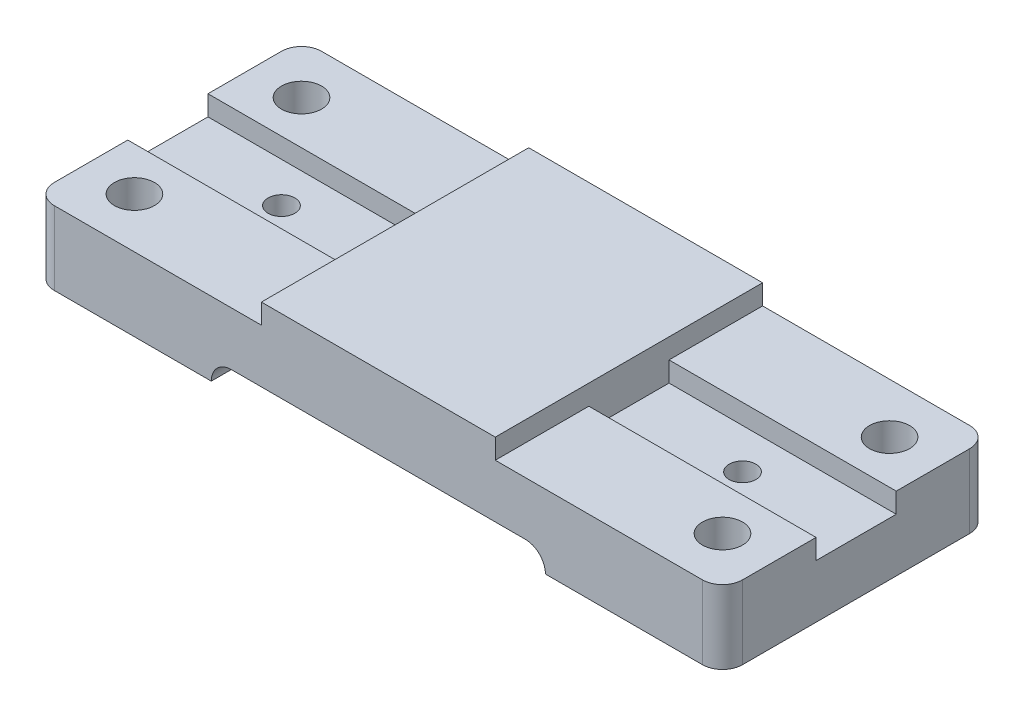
ISO-10303-21;
HEADER;
FILE_DESCRIPTION(('STEP AP214'),'2;1');
FILE_NAME('part.step','',(''),(''),'','','');
FILE_SCHEMA(('AUTOMOTIVE_DESIGN { 1 0 10303 214 1 1 1 1 }'));
ENDSEC;
DATA;
#1=APPLICATION_CONTEXT('core data for automotive mechanical design processes');
#2=APPLICATION_PROTOCOL_DEFINITION('international standard','automotive_design',2000,#1);
#3=PRODUCT_CONTEXT('',#1,'mechanical');
#4=PRODUCT('Part','Part','',(#3));
#5=PRODUCT_RELATED_PRODUCT_CATEGORY('part','',(#4));
#6=PRODUCT_DEFINITION_FORMATION('','',#4);
#7=PRODUCT_DEFINITION_CONTEXT('part definition',#1,'design');
#8=PRODUCT_DEFINITION('design','',#6,#7);
#9=PRODUCT_DEFINITION_SHAPE('','',#8);
#10=(LENGTH_UNIT() NAMED_UNIT(*) SI_UNIT(.MILLI.,.METRE.));
#11=(NAMED_UNIT(*) PLANE_ANGLE_UNIT() SI_UNIT($,.RADIAN.));
#12=(NAMED_UNIT(*) SI_UNIT($,.STERADIAN.) SOLID_ANGLE_UNIT());
#13=UNCERTAINTY_MEASURE_WITH_UNIT(LENGTH_MEASURE(1.E-05),#10,'distance_accuracy_value','');
#14=(GEOMETRIC_REPRESENTATION_CONTEXT(3) GLOBAL_UNCERTAINTY_ASSIGNED_CONTEXT((#13)) GLOBAL_UNIT_ASSIGNED_CONTEXT((#10,
#11,#12)) REPRESENTATION_CONTEXT('',''));
#15=CARTESIAN_POINT('',(0.,0.,0.));
#16=DIRECTION('',(0.,0.,1.));
#17=DIRECTION('',(1.,0.,0.));
#18=AXIS2_PLACEMENT_3D('',#15,#16,#17);
#19=CARTESIAN_POINT('',(200.,22.,-74.));
#20=DIRECTION('',(0.,1.,0.));
#21=DIRECTION('',(0.,0.,1.));
#22=AXIS2_PLACEMENT_3D('',#19,#20,#21);
#23=PLANE('',#22);
#24=DIRECTION('',(0.,0.,-1.));
#25=VECTOR('',#24,1.);
#26=CARTESIAN_POINT('',(138.,22.,-80.));
#27=LINE('',#26,#25);
#28=CARTESIAN_POINT('',(138.,22.,0.));
#29=VERTEX_POINT('',#28);
#30=CARTESIAN_POINT('',(138.,22.,-28.));
#31=VERTEX_POINT('',#30);
#32=EDGE_CURVE('E48',#29,#31,#27,.T.);
#33=ORIENTED_EDGE('',*,*,#32,.F.);
#34=DIRECTION('',(1.,0.,0.));
#35=VECTOR('',#34,1.);
#36=CARTESIAN_POINT('',(6.00000000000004,22.,0.));
#37=LINE('',#36,#35);
#38=CARTESIAN_POINT('',(200.,22.,0.));
#39=VERTEX_POINT('',#38);
#40=EDGE_CURVE('E208',#29,#39,#37,.T.);
#41=ORIENTED_EDGE('',*,*,#40,.T.);
#42=CARTESIAN_POINT('',(200.,22.,-6.));
#43=DIRECTION('',(0.,1.,0.));
#44=DIRECTION('',(0.,0.,1.));
#45=AXIS2_PLACEMENT_3D('',#42,#43,#44);
#46=CIRCLE('',#45,6.);
#47=CARTESIAN_POINT('',(206.,22.,-6.00000000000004));
#48=VERTEX_POINT('',#47);
#49=EDGE_CURVE('E207',#39,#48,#46,.T.);
#50=ORIENTED_EDGE('',*,*,#49,.T.);
#51=DIRECTION('',(0.,0.,-1.));
#52=VECTOR('',#51,1.);
#53=CARTESIAN_POINT('',(206.,22.,-6.00000000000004));
#54=LINE('',#53,#52);
#55=CARTESIAN_POINT('',(206.,22.,-28.));
#56=VERTEX_POINT('',#55);
#57=EDGE_CURVE('E416',#48,#56,#54,.T.);
#58=ORIENTED_EDGE('',*,*,#57,.T.);
#59=DIRECTION('',(1.,0.,0.));
#60=VECTOR('',#59,1.);
#61=CARTESIAN_POINT('',(-69.0302807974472,22.,-28.));
#62=LINE('',#61,#60);
#63=EDGE_CURVE('E273',#31,#56,#62,.T.);
#64=ORIENTED_EDGE('',*,*,#63,.F.);
#65=EDGE_LOOP('',(#33,#41,#50,#58,#64));
#66=FACE_BOUND('',#65,.T.);
#67=CARTESIAN_POINT('',(191.,22.,-15.));
#68=DIRECTION('',(0.,1.,0.));
#69=DIRECTION('',(0.,0.,1.));
#70=AXIS2_PLACEMENT_3D('',#67,#68,#69);
#71=CIRCLE('',#70,6.00000000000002);
#72=CARTESIAN_POINT('',(191.,22.,-8.99999999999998));
#73=VERTEX_POINT('',#72);
#74=EDGE_CURVE('E340',#73,#73,#71,.T.);
#75=ORIENTED_EDGE('',*,*,#74,.F.);
#76=EDGE_LOOP('',(#75));
#77=FACE_BOUND('',#76,.T.);
#78=ADVANCED_FACE('F31',(#66,#77),#23,.T.);
#79=CARTESIAN_POINT('',(138.,22.,-52.));
#80=VERTEX_POINT('',#79);
#81=CARTESIAN_POINT('',(138.,22.,-80.));
#82=VERTEX_POINT('',#81);
#83=EDGE_CURVE('E11',#80,#82,#27,.T.);
#84=ORIENTED_EDGE('',*,*,#83,.F.);
#85=DIRECTION('',(1.,0.,0.));
#86=VECTOR('',#85,1.);
#87=CARTESIAN_POINT('',(-69.0302807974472,22.,-52.));
#88=LINE('',#87,#86);
#89=CARTESIAN_POINT('',(206.,22.,-52.));
#90=VERTEX_POINT('',#89);
#91=EDGE_CURVE('E228',#80,#90,#88,.T.);
#92=ORIENTED_EDGE('',*,*,#91,.T.);
#93=CARTESIAN_POINT('',(206.,22.,-74.));
#94=VERTEX_POINT('',#93);
#95=EDGE_CURVE('E419',#90,#94,#54,.T.);
#96=ORIENTED_EDGE('',*,*,#95,.T.);
#97=CARTESIAN_POINT('',(200.,22.,-74.));
#98=DIRECTION('',(0.,1.,0.));
#99=DIRECTION('',(0.,0.,1.));
#100=AXIS2_PLACEMENT_3D('',#97,#98,#99);
#101=CIRCLE('',#100,6.00000000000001);
#102=CARTESIAN_POINT('',(200.,22.,-80.));
#103=VERTEX_POINT('',#102);
#104=EDGE_CURVE('E381',#94,#103,#101,.T.);
#105=ORIENTED_EDGE('',*,*,#104,.T.);
#106=DIRECTION('',(-1.,0.,0.));
#107=VECTOR('',#106,1.);
#108=CARTESIAN_POINT('',(6.00000000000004,22.,-80.));
#109=LINE('',#108,#107);
#110=EDGE_CURVE('E392',#103,#82,#109,.T.);
#111=ORIENTED_EDGE('',*,*,#110,.T.);
#112=EDGE_LOOP('',(#84,#92,#96,#105,#111));
#113=FACE_BOUND('',#112,.T.);
#114=CARTESIAN_POINT('',(191.,22.,-65.));
#115=DIRECTION('',(0.,1.,0.));
#116=DIRECTION('',(0.,0.,1.));
#117=AXIS2_PLACEMENT_3D('',#114,#115,#116);
#118=CIRCLE('',#117,6.00000000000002);
#119=CARTESIAN_POINT('',(191.,22.,-59.));
#120=VERTEX_POINT('',#119);
#121=EDGE_CURVE('E352',#120,#120,#118,.T.);
#122=ORIENTED_EDGE('',*,*,#121,.F.);
#123=EDGE_LOOP('',(#122));
#124=FACE_BOUND('',#123,.T.);
#125=ADVANCED_FACE('F523',(#113,#124),#23,.T.);
#126=DIRECTION('',(0.,0.,1.));
#127=VECTOR('',#126,1.);
#128=CARTESIAN_POINT('',(68.,22.,-80.));
#129=LINE('',#128,#127);
#130=CARTESIAN_POINT('',(68.,22.,-80.));
#131=VERTEX_POINT('',#130);
#132=CARTESIAN_POINT('',(68.,22.,-52.));
#133=VERTEX_POINT('',#132);
#134=EDGE_CURVE('E56',#131,#133,#129,.T.);
#135=ORIENTED_EDGE('',*,*,#134,.F.);
#136=CARTESIAN_POINT('',(6.00000000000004,22.,-80.));
#137=VERTEX_POINT('',#136);
#138=EDGE_CURVE('E384',#131,#137,#109,.T.);
#139=ORIENTED_EDGE('',*,*,#138,.T.);
#140=CARTESIAN_POINT('',(6.,22.,-74.));
#141=DIRECTION('',(0.,1.,0.));
#142=DIRECTION('',(0.,0.,1.));
#143=AXIS2_PLACEMENT_3D('',#140,#141,#142);
#144=CIRCLE('',#143,6.);
#145=CARTESIAN_POINT('',(0.,22.,-74.));
#146=VERTEX_POINT('',#145);
#147=EDGE_CURVE('E387',#137,#146,#144,.T.);
#148=ORIENTED_EDGE('',*,*,#147,.T.);
#149=DIRECTION('',(0.,0.,1.));
#150=VECTOR('',#149,1.);
#151=CARTESIAN_POINT('',(0.,22.,-6.00000000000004));
#152=LINE('',#151,#150);
#153=CARTESIAN_POINT('',(0.,22.,-52.));
#154=VERTEX_POINT('',#153);
#155=EDGE_CURVE('E568',#146,#154,#152,.T.);
#156=ORIENTED_EDGE('',*,*,#155,.T.);
#157=DIRECTION('',(1.,0.,0.));
#158=VECTOR('',#157,1.);
#159=CARTESIAN_POINT('',(-69.0302807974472,22.,-52.));
#160=LINE('',#159,#158);
#161=EDGE_CURVE('E244',#154,#133,#160,.T.);
#162=ORIENTED_EDGE('',*,*,#161,.T.);
#163=EDGE_LOOP('',(#135,#139,#148,#156,#162));
#164=FACE_BOUND('',#163,.T.);
#165=CARTESIAN_POINT('',(15.,22.,-65.));
#166=DIRECTION('',(0.,1.,0.));
#167=DIRECTION('',(0.,0.,1.));
#168=AXIS2_PLACEMENT_3D('',#165,#166,#167);
#169=CIRCLE('',#168,6.);
#170=CARTESIAN_POINT('',(15.,22.,-59.));
#171=VERTEX_POINT('',#170);
#172=EDGE_CURVE('E358',#171,#171,#169,.T.);
#173=ORIENTED_EDGE('',*,*,#172,.F.);
#174=EDGE_LOOP('',(#173));
#175=FACE_BOUND('',#174,.T.);
#176=ADVANCED_FACE('F528',(#164,#175),#23,.T.);
#177=CARTESIAN_POINT('',(68.,22.,-28.));
#178=VERTEX_POINT('',#177);
#179=CARTESIAN_POINT('',(68.,22.,0.));
#180=VERTEX_POINT('',#179);
#181=EDGE_CURVE('E40',#178,#180,#129,.T.);
#182=ORIENTED_EDGE('',*,*,#181,.F.);
#183=DIRECTION('',(1.,0.,0.));
#184=VECTOR('',#183,1.);
#185=CARTESIAN_POINT('',(-69.0302807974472,22.,-28.));
#186=LINE('',#185,#184);
#187=CARTESIAN_POINT('',(0.,22.,-28.));
#188=VERTEX_POINT('',#187);
#189=EDGE_CURVE('E241',#188,#178,#186,.T.);
#190=ORIENTED_EDGE('',*,*,#189,.F.);
#191=CARTESIAN_POINT('',(0.,22.,-6.00000000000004));
#192=VERTEX_POINT('',#191);
#193=EDGE_CURVE('E567',#188,#192,#152,.T.);
#194=ORIENTED_EDGE('',*,*,#193,.T.);
#195=CARTESIAN_POINT('',(6.,22.,-6.));
#196=DIRECTION('',(0.,1.,0.));
#197=DIRECTION('',(0.,0.,-1.));
#198=AXIS2_PLACEMENT_3D('',#195,#196,#197);
#199=CIRCLE('',#198,6.);
#200=CARTESIAN_POINT('',(6.00000000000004,22.,0.));
#201=VERTEX_POINT('',#200);
#202=EDGE_CURVE('E202',#192,#201,#199,.T.);
#203=ORIENTED_EDGE('',*,*,#202,.T.);
#204=EDGE_CURVE('E195',#201,#180,#37,.T.);
#205=ORIENTED_EDGE('',*,*,#204,.T.);
#206=EDGE_LOOP('',(#182,#190,#194,#203,#205));
#207=FACE_BOUND('',#206,.T.);
#208=CARTESIAN_POINT('',(15.,22.,-15.));
#209=DIRECTION('',(0.,1.,0.));
#210=DIRECTION('',(0.,0.,1.));
#211=AXIS2_PLACEMENT_3D('',#208,#209,#210);
#212=CIRCLE('',#211,6.);
#213=CARTESIAN_POINT('',(15.,22.,-9.));
#214=VERTEX_POINT('',#213);
#215=EDGE_CURVE('E346',#214,#214,#212,.T.);
#216=ORIENTED_EDGE('',*,*,#215,.F.);
#217=EDGE_LOOP('',(#216));
#218=FACE_BOUND('',#217,.T.);
#219=ADVANCED_FACE('F197',(#207,#218),#23,.T.);
#220=CARTESIAN_POINT('',(206.,22.,-6.00000000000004));
#221=DIRECTION('',(-1.,0.,0.));
#222=DIRECTION('',(0.,0.,1.));
#223=AXIS2_PLACEMENT_3D('',#220,#221,#222);
#224=PLANE('',#223);
#225=DIRECTION('',(0.,1.,0.));
#226=VECTOR('',#225,1.);
#227=CARTESIAN_POINT('',(206.,16.,-52.));
#228=LINE('',#227,#226);
#229=CARTESIAN_POINT('',(206.,16.,-52.));
#230=VERTEX_POINT('',#229);
#231=EDGE_CURVE('E254',#230,#90,#228,.T.);
#232=ORIENTED_EDGE('',*,*,#231,.F.);
#233=DIRECTION('',(0.,0.,-1.));
#234=VECTOR('',#233,1.);
#235=CARTESIAN_POINT('',(206.,16.,-40.));
#236=LINE('',#235,#234);
#237=CARTESIAN_POINT('',(206.,16.,-28.));
#238=VERTEX_POINT('',#237);
#239=EDGE_CURVE('E268',#238,#230,#236,.T.);
#240=ORIENTED_EDGE('',*,*,#239,.F.);
#241=DIRECTION('',(0.,1.,0.));
#242=VECTOR('',#241,1.);
#243=CARTESIAN_POINT('',(206.,16.,-28.));
#244=LINE('',#243,#242);
#245=EDGE_CURVE('E277',#238,#56,#244,.T.);
#246=ORIENTED_EDGE('',*,*,#245,.T.);
#247=ORIENTED_EDGE('',*,*,#57,.F.);
#248=DIRECTION('',(0.,-1.,0.));
#249=VECTOR('',#248,1.);
#250=CARTESIAN_POINT('',(206.,22.,-6.00000000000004));
#251=LINE('',#250,#249);
#252=CARTESIAN_POINT('',(206.,0.,-6.00000000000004));
#253=VERTEX_POINT('',#252);
#254=EDGE_CURVE('E410',#48,#253,#251,.T.);
#255=ORIENTED_EDGE('',*,*,#254,.T.);
#256=DIRECTION('',(0.,0.,-1.));
#257=VECTOR('',#256,1.);
#258=CARTESIAN_POINT('',(206.,0.,-6.00000000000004));
#259=LINE('',#258,#257);
#260=CARTESIAN_POINT('',(206.,0.,-74.));
#261=VERTEX_POINT('',#260);
#262=EDGE_CURVE('E379',#253,#261,#259,.T.);
#263=ORIENTED_EDGE('',*,*,#262,.T.);
#264=DIRECTION('',(0.,-1.,0.));
#265=VECTOR('',#264,1.);
#266=CARTESIAN_POINT('',(206.,22.,-74.));
#267=LINE('',#266,#265);
#268=EDGE_CURVE('E413',#94,#261,#267,.T.);
#269=ORIENTED_EDGE('',*,*,#268,.F.);
#270=ORIENTED_EDGE('',*,*,#95,.F.);
#271=EDGE_LOOP('',(#232,#240,#246,#247,#255,#263,#269,#270));
#272=FACE_BOUND('',#271,.T.);
#273=ADVANCED_FACE('F533',(#272),#224,.F.);
#274=CARTESIAN_POINT('',(200.,0.,-74.));
#275=DIRECTION('',(0.,1.,0.));
#276=DIRECTION('',(0.,0.,1.));
#277=AXIS2_PLACEMENT_3D('',#274,#275,#276);
#278=PLANE('',#277);
#279=CARTESIAN_POINT('',(34.,0.,-40.));
#280=DIRECTION('',(0.,-1.,0.));
#281=DIRECTION('',(0.,0.,-1.));
#282=AXIS2_PLACEMENT_3D('',#279,#280,#281);
#283=CIRCLE('',#282,7.);
#284=CARTESIAN_POINT('',(34.,0.,-47.));
#285=VERTEX_POINT('',#284);
#286=EDGE_CURVE('E451',#285,#285,#283,.T.);
#287=ORIENTED_EDGE('',*,*,#286,.F.);
#288=EDGE_LOOP('',(#287));
#289=FACE_BOUND('',#288,.T.);
#290=CARTESIAN_POINT('',(15.,0.,-65.));
#291=DIRECTION('',(0.,1.,0.));
#292=DIRECTION('',(0.,0.,1.));
#293=AXIS2_PLACEMENT_3D('',#290,#291,#292);
#294=CIRCLE('',#293,6.);
#295=CARTESIAN_POINT('',(15.,0.,-59.));
#296=VERTEX_POINT('',#295);
#297=EDGE_CURVE('E355',#296,#296,#294,.T.);
#298=ORIENTED_EDGE('',*,*,#297,.T.);
#299=EDGE_LOOP('',(#298));
#300=FACE_BOUND('',#299,.T.);
#301=CARTESIAN_POINT('',(15.,0.,-15.));
#302=DIRECTION('',(0.,1.,0.));
#303=DIRECTION('',(0.,0.,1.));
#304=AXIS2_PLACEMENT_3D('',#301,#302,#303);
#305=CIRCLE('',#304,6.);
#306=CARTESIAN_POINT('',(15.,0.,-9.));
#307=VERTEX_POINT('',#306);
#308=EDGE_CURVE('E343',#307,#307,#305,.T.);
#309=ORIENTED_EDGE('',*,*,#308,.T.);
#310=EDGE_LOOP('',(#309));
#311=FACE_BOUND('',#310,.T.);
#312=DIRECTION('',(-1.,0.,0.));
#313=VECTOR('',#312,1.);
#314=CARTESIAN_POINT('',(6.00000000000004,0.,-80.));
#315=LINE('',#314,#313);
#316=CARTESIAN_POINT('',(53.,0.,-80.));
#317=VERTEX_POINT('',#316);
#318=CARTESIAN_POINT('',(6.00000000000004,0.,-80.));
#319=VERTEX_POINT('',#318);
#320=EDGE_CURVE('E364',#317,#319,#315,.T.);
#321=ORIENTED_EDGE('',*,*,#320,.F.);
#322=DIRECTION('',(0.,0.,1.));
#323=VECTOR('',#322,1.);
#324=CARTESIAN_POINT('',(53.,0.,-80.));
#325=LINE('',#324,#323);
#326=CARTESIAN_POINT('',(53.,0.,0.));
#327=VERTEX_POINT('',#326);
#328=EDGE_CURVE('E328',#317,#327,#325,.T.);
#329=ORIENTED_EDGE('',*,*,#328,.T.);
#330=DIRECTION('',(1.,0.,0.));
#331=VECTOR('',#330,1.);
#332=CARTESIAN_POINT('',(6.00000000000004,0.,0.));
#333=LINE('',#332,#331);
#334=CARTESIAN_POINT('',(6.00000000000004,0.,0.));
#335=VERTEX_POINT('',#334);
#336=EDGE_CURVE('E375',#335,#327,#333,.T.);
#337=ORIENTED_EDGE('',*,*,#336,.F.);
#338=CARTESIAN_POINT('',(6.,0.,-6.));
#339=DIRECTION('',(0.,1.,0.));
#340=DIRECTION('',(0.,0.,-1.));
#341=AXIS2_PLACEMENT_3D('',#338,#339,#340);
#342=CIRCLE('',#341,6.);
#343=CARTESIAN_POINT('',(0.,0.,-6.00000000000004));
#344=VERTEX_POINT('',#343);
#345=EDGE_CURVE('E372',#344,#335,#342,.T.);
#346=ORIENTED_EDGE('',*,*,#345,.F.);
#347=DIRECTION('',(0.,0.,1.));
#348=VECTOR('',#347,1.);
#349=CARTESIAN_POINT('',(0.,0.,-6.00000000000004));
#350=LINE('',#349,#348);
#351=CARTESIAN_POINT('',(0.,0.,-74.));
#352=VERTEX_POINT('',#351);
#353=EDGE_CURVE('E370',#352,#344,#350,.T.);
#354=ORIENTED_EDGE('',*,*,#353,.F.);
#355=CARTESIAN_POINT('',(6.,0.,-74.));
#356=DIRECTION('',(0.,1.,0.));
#357=DIRECTION('',(0.,0.,1.));
#358=AXIS2_PLACEMENT_3D('',#355,#356,#357);
#359=CIRCLE('',#358,6.);
#360=EDGE_CURVE('E368',#319,#352,#359,.T.);
#361=ORIENTED_EDGE('',*,*,#360,.F.);
#362=EDGE_LOOP('',(#321,#329,#337,#346,#354,#361));
#363=FACE_BOUND('',#362,.T.);
#364=ADVANCED_FACE('F496',(#289,#300,#311,#363),#278,.F.);
#365=CARTESIAN_POINT('',(172.,0.,-40.));
#366=DIRECTION('',(0.,-1.,0.));
#367=DIRECTION('',(0.,0.,-1.));
#368=AXIS2_PLACEMENT_3D('',#365,#366,#367);
#369=CIRCLE('',#368,7.00000000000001);
#370=CARTESIAN_POINT('',(172.,0.,-47.));
#371=VERTEX_POINT('',#370);
#372=EDGE_CURVE('E459',#371,#371,#369,.T.);
#373=ORIENTED_EDGE('',*,*,#372,.F.);
#374=EDGE_LOOP('',(#373));
#375=FACE_BOUND('',#374,.T.);
#376=CARTESIAN_POINT('',(153.,0.,0.));
#377=VERTEX_POINT('',#376);
#378=CARTESIAN_POINT('',(200.,0.,0.));
#379=VERTEX_POINT('',#378);
#380=EDGE_CURVE('E374',#377,#379,#333,.T.);
#381=ORIENTED_EDGE('',*,*,#380,.F.);
#382=DIRECTION('',(0.,0.,1.));
#383=VECTOR('',#382,1.);
#384=CARTESIAN_POINT('',(153.,0.,-80.));
#385=LINE('',#384,#383);
#386=CARTESIAN_POINT('',(153.,0.,-80.));
#387=VERTEX_POINT('',#386);
#388=EDGE_CURVE('E334',#387,#377,#385,.T.);
#389=ORIENTED_EDGE('',*,*,#388,.F.);
#390=CARTESIAN_POINT('',(200.,0.,-80.));
#391=VERTEX_POINT('',#390);
#392=EDGE_CURVE('E365',#391,#387,#315,.T.);
#393=ORIENTED_EDGE('',*,*,#392,.F.);
#394=CARTESIAN_POINT('',(200.,0.,-74.));
#395=DIRECTION('',(0.,1.,0.));
#396=DIRECTION('',(0.,0.,1.));
#397=AXIS2_PLACEMENT_3D('',#394,#395,#396);
#398=CIRCLE('',#397,6.00000000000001);
#399=EDGE_CURVE('E361',#261,#391,#398,.T.);
#400=ORIENTED_EDGE('',*,*,#399,.F.);
#401=ORIENTED_EDGE('',*,*,#262,.F.);
#402=CARTESIAN_POINT('',(200.,0.,-6.));
#403=DIRECTION('',(0.,1.,0.));
#404=DIRECTION('',(0.,0.,1.));
#405=AXIS2_PLACEMENT_3D('',#402,#403,#404);
#406=CIRCLE('',#405,6.);
#407=EDGE_CURVE('E377',#379,#253,#406,.T.);
#408=ORIENTED_EDGE('',*,*,#407,.F.);
#409=EDGE_LOOP('',(#381,#389,#393,#400,#401,#408));
#410=FACE_BOUND('',#409,.T.);
#411=CARTESIAN_POINT('',(191.,0.,-65.));
#412=DIRECTION('',(0.,1.,0.));
#413=DIRECTION('',(0.,0.,1.));
#414=AXIS2_PLACEMENT_3D('',#411,#412,#413);
#415=CIRCLE('',#414,6.00000000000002);
#416=CARTESIAN_POINT('',(191.,0.,-59.));
#417=VERTEX_POINT('',#416);
#418=EDGE_CURVE('E349',#417,#417,#415,.T.);
#419=ORIENTED_EDGE('',*,*,#418,.T.);
#420=EDGE_LOOP('',(#419));
#421=FACE_BOUND('',#420,.T.);
#422=CARTESIAN_POINT('',(191.,0.,-15.));
#423=DIRECTION('',(0.,1.,0.));
#424=DIRECTION('',(0.,0.,1.));
#425=AXIS2_PLACEMENT_3D('',#422,#423,#424);
#426=CIRCLE('',#425,6.00000000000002);
#427=CARTESIAN_POINT('',(191.,0.,-8.99999999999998));
#428=VERTEX_POINT('',#427);
#429=EDGE_CURVE('E331',#428,#428,#426,.T.);
#430=ORIENTED_EDGE('',*,*,#429,.T.);
#431=EDGE_LOOP('',(#430));
#432=FACE_BOUND('',#431,.T.);
#433=ADVANCED_FACE('F493',(#375,#410,#421,#432),#278,.F.);
#434=CARTESIAN_POINT('',(200.,22.,-74.));
#435=DIRECTION('',(0.,-1.,0.));
#436=DIRECTION('',(0.,0.,-1.));
#437=AXIS2_PLACEMENT_3D('',#434,#435,#436);
#438=CYLINDRICAL_SURFACE('',#437,6.00000000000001);
#439=ORIENTED_EDGE('',*,*,#399,.T.);
#440=DIRECTION('',(0.,-1.,0.));
#441=VECTOR('',#440,1.);
#442=CARTESIAN_POINT('',(200.,22.,-80.));
#443=LINE('',#442,#441);
#444=EDGE_CURVE('E218',#103,#391,#443,.T.);
#445=ORIENTED_EDGE('',*,*,#444,.F.);
#446=ORIENTED_EDGE('',*,*,#104,.F.);
#447=ORIENTED_EDGE('',*,*,#268,.T.);
#448=EDGE_LOOP('',(#439,#445,#446,#447));
#449=FACE_BOUND('',#448,.T.);
#450=ADVANCED_FACE('F33',(#449),#438,.T.);
#451=CARTESIAN_POINT('',(6.00000000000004,22.,-80.));
#452=DIRECTION('',(0.,0.,1.));
#453=DIRECTION('',(1.,0.,0.));
#454=AXIS2_PLACEMENT_3D('',#451,#452,#453);
#455=PLANE('',#454);
#456=DIRECTION('',(-1.,0.,0.));
#457=VECTOR('',#456,1.);
#458=CARTESIAN_POINT('',(59.,6.,-80.));
#459=LINE('',#458,#457);
#460=CARTESIAN_POINT('',(147.,6.,-80.));
#461=VERTEX_POINT('',#460);
#462=CARTESIAN_POINT('',(59.,6.,-80.));
#463=VERTEX_POINT('',#462);
#464=EDGE_CURVE('E325',#461,#463,#459,.T.);
#465=ORIENTED_EDGE('',*,*,#464,.T.);
#466=CARTESIAN_POINT('',(59.,0.,-80.));
#467=DIRECTION('',(0.,0.,1.));
#468=DIRECTION('',(1.,0.,0.));
#469=AXIS2_PLACEMENT_3D('',#466,#467,#468);
#470=CIRCLE('',#469,6.);
#471=EDGE_CURVE('E319',#463,#317,#470,.T.);
#472=ORIENTED_EDGE('',*,*,#471,.T.);
#473=ORIENTED_EDGE('',*,*,#320,.T.);
#474=DIRECTION('',(0.,-1.,0.));
#475=VECTOR('',#474,1.);
#476=CARTESIAN_POINT('',(6.00000000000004,22.,-80.));
#477=LINE('',#476,#475);
#478=EDGE_CURVE('E396',#137,#319,#477,.T.);
#479=ORIENTED_EDGE('',*,*,#478,.F.);
#480=ORIENTED_EDGE('',*,*,#138,.F.);
#481=DIRECTION('',(0.,-1.,0.));
#482=VECTOR('',#481,1.);
#483=CARTESIAN_POINT('',(68.,28.,-80.));
#484=LINE('',#483,#482);
#485=CARTESIAN_POINT('',(68.,28.,-80.));
#486=VERTEX_POINT('',#485);
#487=EDGE_CURVE('E224',#486,#131,#484,.T.);
#488=ORIENTED_EDGE('',*,*,#487,.F.);
#489=DIRECTION('',(-1.,0.,0.));
#490=VECTOR('',#489,1.);
#491=CARTESIAN_POINT('',(68.,28.,-80.));
#492=LINE('',#491,#490);
#493=CARTESIAN_POINT('',(138.,28.,-80.));
#494=VERTEX_POINT('',#493);
#495=EDGE_CURVE('E432',#494,#486,#492,.T.);
#496=ORIENTED_EDGE('',*,*,#495,.F.);
#497=DIRECTION('',(0.,-1.,0.));
#498=VECTOR('',#497,1.);
#499=CARTESIAN_POINT('',(138.,28.,-80.));
#500=LINE('',#499,#498);
#501=EDGE_CURVE('E231',#494,#82,#500,.T.);
#502=ORIENTED_EDGE('',*,*,#501,.T.);
#503=ORIENTED_EDGE('',*,*,#110,.F.);
#504=ORIENTED_EDGE('',*,*,#444,.T.);
#505=ORIENTED_EDGE('',*,*,#392,.T.);
#506=CARTESIAN_POINT('',(147.,0.,-80.));
#507=DIRECTION('',(0.,0.,1.));
#508=DIRECTION('',(1.,0.,0.));
#509=AXIS2_PLACEMENT_3D('',#506,#507,#508);
#510=CIRCLE('',#509,6.);
#511=EDGE_CURVE('E322',#387,#461,#510,.T.);
#512=ORIENTED_EDGE('',*,*,#511,.T.);
#513=EDGE_LOOP('',(#465,#472,#473,#479,#480,#488,#496,#502,#503,#504,#505,#512));
#514=FACE_BOUND('',#513,.T.);
#515=ADVANCED_FACE('F446',(#514),#455,.F.);
#516=CARTESIAN_POINT('',(6.,22.,-74.));
#517=DIRECTION('',(0.,-1.,0.));
#518=DIRECTION('',(0.,0.,-1.));
#519=AXIS2_PLACEMENT_3D('',#516,#517,#518);
#520=CYLINDRICAL_SURFACE('',#519,6.);
#521=ORIENTED_EDGE('',*,*,#360,.T.);
#522=DIRECTION('',(0.,-1.,0.));
#523=VECTOR('',#522,1.);
#524=CARTESIAN_POINT('',(0.,22.,-74.));
#525=LINE('',#524,#523);
#526=EDGE_CURVE('E399',#146,#352,#525,.T.);
#527=ORIENTED_EDGE('',*,*,#526,.F.);
#528=ORIENTED_EDGE('',*,*,#147,.F.);
#529=ORIENTED_EDGE('',*,*,#478,.T.);
#530=EDGE_LOOP('',(#521,#527,#528,#529));
#531=FACE_BOUND('',#530,.T.);
#532=ADVANCED_FACE('F563',(#531),#520,.T.);
#533=CARTESIAN_POINT('',(0.,22.,-6.00000000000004));
#534=DIRECTION('',(1.,0.,0.));
#535=DIRECTION('',(0.,0.,-1.));
#536=AXIS2_PLACEMENT_3D('',#533,#534,#535);
#537=PLANE('',#536);
#538=ORIENTED_EDGE('',*,*,#193,.F.);
#539=DIRECTION('',(0.,1.,0.));
#540=VECTOR('',#539,1.);
#541=CARTESIAN_POINT('',(0.,16.,-28.));
#542=LINE('',#541,#540);
#543=CARTESIAN_POINT('',(0.,16.,-28.));
#544=VERTEX_POINT('',#543);
#545=EDGE_CURVE('E238',#544,#188,#542,.T.);
#546=ORIENTED_EDGE('',*,*,#545,.F.);
#547=DIRECTION('',(0.,0.,1.));
#548=VECTOR('',#547,1.);
#549=CARTESIAN_POINT('',(0.,16.,-40.));
#550=LINE('',#549,#548);
#551=CARTESIAN_POINT('',(0.,16.,-52.));
#552=VERTEX_POINT('',#551);
#553=EDGE_CURVE('E305',#552,#544,#550,.T.);
#554=ORIENTED_EDGE('',*,*,#553,.F.);
#555=DIRECTION('',(0.,1.,0.));
#556=VECTOR('',#555,1.);
#557=CARTESIAN_POINT('',(0.,16.,-52.));
#558=LINE('',#557,#556);
#559=EDGE_CURVE('E249',#552,#154,#558,.T.);
#560=ORIENTED_EDGE('',*,*,#559,.T.);
#561=ORIENTED_EDGE('',*,*,#155,.F.);
#562=ORIENTED_EDGE('',*,*,#526,.T.);
#563=ORIENTED_EDGE('',*,*,#353,.T.);
#564=DIRECTION('',(0.,-1.,0.));
#565=VECTOR('',#564,1.);
#566=CARTESIAN_POINT('',(0.,22.,-6.00000000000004));
#567=LINE('',#566,#565);
#568=EDGE_CURVE('E402',#192,#344,#567,.T.);
#569=ORIENTED_EDGE('',*,*,#568,.F.);
#570=EDGE_LOOP('',(#538,#546,#554,#560,#561,#562,#563,#569));
#571=FACE_BOUND('',#570,.T.);
#572=ADVANCED_FACE('F572',(#571),#537,.F.);
#573=CARTESIAN_POINT('',(6.,22.,-6.));
#574=DIRECTION('',(0.,-1.,0.));
#575=DIRECTION('',(0.,0.,-1.));
#576=AXIS2_PLACEMENT_3D('',#573,#574,#575);
#577=CYLINDRICAL_SURFACE('',#576,6.);
#578=ORIENTED_EDGE('',*,*,#345,.T.);
#579=DIRECTION('',(0.,-1.,0.));
#580=VECTOR('',#579,1.);
#581=CARTESIAN_POINT('',(6.00000000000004,22.,0.));
#582=LINE('',#581,#580);
#583=EDGE_CURVE('E405',#201,#335,#582,.T.);
#584=ORIENTED_EDGE('',*,*,#583,.F.);
#585=ORIENTED_EDGE('',*,*,#202,.F.);
#586=ORIENTED_EDGE('',*,*,#568,.T.);
#587=EDGE_LOOP('',(#578,#584,#585,#586));
#588=FACE_BOUND('',#587,.T.);
#589=ADVANCED_FACE('F585',(#588),#577,.T.);
#590=CARTESIAN_POINT('',(6.00000000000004,22.,0.));
#591=DIRECTION('',(0.,0.,-1.));
#592=DIRECTION('',(-1.,0.,0.));
#593=AXIS2_PLACEMENT_3D('',#590,#591,#592);
#594=PLANE('',#593);
#595=ORIENTED_EDGE('',*,*,#336,.T.);
#596=CARTESIAN_POINT('',(59.,0.,0.));
#597=DIRECTION('',(0.,0.,1.));
#598=DIRECTION('',(1.,0.,0.));
#599=AXIS2_PLACEMENT_3D('',#596,#597,#598);
#600=CIRCLE('',#599,6.);
#601=CARTESIAN_POINT('',(59.,6.,0.));
#602=VERTEX_POINT('',#601);
#603=EDGE_CURVE('E237',#602,#327,#600,.T.);
#604=ORIENTED_EDGE('',*,*,#603,.F.);
#605=DIRECTION('',(-1.,0.,0.));
#606=VECTOR('',#605,1.);
#607=CARTESIAN_POINT('',(59.,6.,0.));
#608=LINE('',#607,#606);
#609=CARTESIAN_POINT('',(147.,6.,0.));
#610=VERTEX_POINT('',#609);
#611=EDGE_CURVE('E316',#610,#602,#608,.T.);
#612=ORIENTED_EDGE('',*,*,#611,.F.);
#613=CARTESIAN_POINT('',(147.,0.,0.));
#614=DIRECTION('',(0.,0.,1.));
#615=DIRECTION('',(1.,0.,0.));
#616=AXIS2_PLACEMENT_3D('',#613,#614,#615);
#617=CIRCLE('',#616,6.);
#618=EDGE_CURVE('E313',#377,#610,#617,.T.);
#619=ORIENTED_EDGE('',*,*,#618,.F.);
#620=ORIENTED_EDGE('',*,*,#380,.T.);
#621=DIRECTION('',(0.,-1.,0.));
#622=VECTOR('',#621,1.);
#623=CARTESIAN_POINT('',(200.,22.,0.));
#624=LINE('',#623,#622);
#625=EDGE_CURVE('E407',#39,#379,#624,.T.);
#626=ORIENTED_EDGE('',*,*,#625,.F.);
#627=ORIENTED_EDGE('',*,*,#40,.F.);
#628=DIRECTION('',(0.,-1.,0.));
#629=VECTOR('',#628,1.);
#630=CARTESIAN_POINT('',(138.,28.,0.));
#631=LINE('',#630,#629);
#632=CARTESIAN_POINT('',(138.,28.,0.));
#633=VERTEX_POINT('',#632);
#634=EDGE_CURVE('E225',#633,#29,#631,.T.);
#635=ORIENTED_EDGE('',*,*,#634,.F.);
#636=DIRECTION('',(1.,0.,0.));
#637=VECTOR('',#636,1.);
#638=CARTESIAN_POINT('',(138.,28.,0.));
#639=LINE('',#638,#637);
#640=CARTESIAN_POINT('',(68.,28.,0.));
#641=VERTEX_POINT('',#640);
#642=EDGE_CURVE('E223',#641,#633,#639,.T.);
#643=ORIENTED_EDGE('',*,*,#642,.F.);
#644=DIRECTION('',(0.,-1.,0.));
#645=VECTOR('',#644,1.);
#646=CARTESIAN_POINT('',(68.,28.,0.));
#647=LINE('',#646,#645);
#648=EDGE_CURVE('E213',#641,#180,#647,.T.);
#649=ORIENTED_EDGE('',*,*,#648,.T.);
#650=ORIENTED_EDGE('',*,*,#204,.F.);
#651=ORIENTED_EDGE('',*,*,#583,.T.);
#652=EDGE_LOOP('',(#595,#604,#612,#619,#620,#626,#627,#635,#643,#649,#650,#651));
#653=FACE_BOUND('',#652,.T.);
#654=ADVANCED_FACE('F221',(#653),#594,.F.);
#655=CARTESIAN_POINT('',(200.,22.,-6.));
#656=DIRECTION('',(0.,-1.,0.));
#657=DIRECTION('',(0.,0.,-1.));
#658=AXIS2_PLACEMENT_3D('',#655,#656,#657);
#659=CYLINDRICAL_SURFACE('',#658,6.);
#660=ORIENTED_EDGE('',*,*,#407,.T.);
#661=ORIENTED_EDGE('',*,*,#254,.F.);
#662=ORIENTED_EDGE('',*,*,#49,.F.);
#663=ORIENTED_EDGE('',*,*,#625,.T.);
#664=EDGE_LOOP('',(#660,#661,#662,#663));
#665=FACE_BOUND('',#664,.T.);
#666=ADVANCED_FACE('F547',(#665),#659,.T.);
#667=CARTESIAN_POINT('',(15.,22.,-65.));
#668=DIRECTION('',(0.,-1.,0.));
#669=DIRECTION('',(0.,0.,-1.));
#670=AXIS2_PLACEMENT_3D('',#667,#668,#669);
#671=CYLINDRICAL_SURFACE('',#670,6.);
#672=ORIENTED_EDGE('',*,*,#172,.T.);
#673=EDGE_LOOP('',(#672));
#674=FACE_BOUND('',#673,.T.);
#675=ORIENTED_EDGE('',*,*,#297,.F.);
#676=EDGE_LOOP('',(#675));
#677=FACE_BOUND('',#676,.T.);
#678=ADVANCED_FACE('F544',(#674,#677),#671,.F.);
#679=CARTESIAN_POINT('',(191.,22.,-65.));
#680=DIRECTION('',(0.,-1.,0.));
#681=DIRECTION('',(0.,0.,-1.));
#682=AXIS2_PLACEMENT_3D('',#679,#680,#681);
#683=CYLINDRICAL_SURFACE('',#682,6.00000000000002);
#684=ORIENTED_EDGE('',*,*,#121,.T.);
#685=EDGE_LOOP('',(#684));
#686=FACE_BOUND('',#685,.T.);
#687=ORIENTED_EDGE('',*,*,#418,.F.);
#688=EDGE_LOOP('',(#687));
#689=FACE_BOUND('',#688,.T.);
#690=ADVANCED_FACE('F519',(#686,#689),#683,.F.);
#691=CARTESIAN_POINT('',(15.,22.,-15.));
#692=DIRECTION('',(0.,-1.,0.));
#693=DIRECTION('',(0.,0.,-1.));
#694=AXIS2_PLACEMENT_3D('',#691,#692,#693);
#695=CYLINDRICAL_SURFACE('',#694,6.);
#696=ORIENTED_EDGE('',*,*,#215,.T.);
#697=EDGE_LOOP('',(#696));
#698=FACE_BOUND('',#697,.T.);
#699=ORIENTED_EDGE('',*,*,#308,.F.);
#700=EDGE_LOOP('',(#699));
#701=FACE_BOUND('',#700,.T.);
#702=ADVANCED_FACE('F509',(#698,#701),#695,.F.);
#703=CARTESIAN_POINT('',(191.,22.,-15.));
#704=DIRECTION('',(0.,-1.,0.));
#705=DIRECTION('',(0.,0.,-1.));
#706=AXIS2_PLACEMENT_3D('',#703,#704,#705);
#707=CYLINDRICAL_SURFACE('',#706,6.00000000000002);
#708=ORIENTED_EDGE('',*,*,#74,.T.);
#709=EDGE_LOOP('',(#708));
#710=FACE_BOUND('',#709,.T.);
#711=ORIENTED_EDGE('',*,*,#429,.F.);
#712=EDGE_LOOP('',(#711));
#713=FACE_BOUND('',#712,.T.);
#714=ADVANCED_FACE('F506',(#710,#713),#707,.F.);
#715=CARTESIAN_POINT('',(59.,0.,-80.));
#716=DIRECTION('',(0.,0.,1.));
#717=DIRECTION('',(1.,0.,0.));
#718=AXIS2_PLACEMENT_3D('',#715,#716,#717);
#719=CYLINDRICAL_SURFACE('',#718,6.);
#720=ORIENTED_EDGE('',*,*,#603,.T.);
#721=ORIENTED_EDGE('',*,*,#328,.F.);
#722=ORIENTED_EDGE('',*,*,#471,.F.);
#723=DIRECTION('',(0.,0.,1.));
#724=VECTOR('',#723,1.);
#725=CARTESIAN_POINT('',(59.,6.,-80.));
#726=LINE('',#725,#724);
#727=EDGE_CURVE('E329',#463,#602,#726,.T.);
#728=ORIENTED_EDGE('',*,*,#727,.T.);
#729=EDGE_LOOP('',(#720,#721,#722,#728));
#730=FACE_BOUND('',#729,.T.);
#731=ADVANCED_FACE('F508',(#730),#719,.F.);
#732=CARTESIAN_POINT('',(59.,6.,-80.));
#733=DIRECTION('',(0.,1.,0.));
#734=DIRECTION('',(0.,0.,1.));
#735=AXIS2_PLACEMENT_3D('',#732,#733,#734);
#736=PLANE('',#735);
#737=ORIENTED_EDGE('',*,*,#611,.T.);
#738=ORIENTED_EDGE('',*,*,#727,.F.);
#739=ORIENTED_EDGE('',*,*,#464,.F.);
#740=DIRECTION('',(0.,0.,1.));
#741=VECTOR('',#740,1.);
#742=CARTESIAN_POINT('',(147.,6.,-80.));
#743=LINE('',#742,#741);
#744=EDGE_CURVE('E332',#461,#610,#743,.T.);
#745=ORIENTED_EDGE('',*,*,#744,.T.);
#746=EDGE_LOOP('',(#737,#738,#739,#745));
#747=FACE_BOUND('',#746,.T.);
#748=ADVANCED_FACE('F516',(#747),#736,.F.);
#749=CARTESIAN_POINT('',(147.,0.,-80.));
#750=DIRECTION('',(0.,0.,1.));
#751=DIRECTION('',(1.,0.,0.));
#752=AXIS2_PLACEMENT_3D('',#749,#750,#751);
#753=CYLINDRICAL_SURFACE('',#752,6.);
#754=ORIENTED_EDGE('',*,*,#618,.T.);
#755=ORIENTED_EDGE('',*,*,#744,.F.);
#756=ORIENTED_EDGE('',*,*,#511,.F.);
#757=ORIENTED_EDGE('',*,*,#388,.T.);
#758=EDGE_LOOP('',(#754,#755,#756,#757));
#759=FACE_BOUND('',#758,.T.);
#760=ADVANCED_FACE('F592',(#759),#753,.F.);
#761=CARTESIAN_POINT('',(68.,16.,-40.));
#762=DIRECTION('',(-1.,0.,0.));
#763=DIRECTION('',(0.,0.,1.));
#764=AXIS2_PLACEMENT_3D('',#761,#762,#763);
#765=PLANE('',#764);
#766=DIRECTION('',(0.,1.,0.));
#767=VECTOR('',#766,1.);
#768=CARTESIAN_POINT('',(68.,16.,-28.));
#769=LINE('',#768,#767);
#770=CARTESIAN_POINT('',(68.,16.,-28.));
#771=VERTEX_POINT('',#770);
#772=EDGE_CURVE('E216',#771,#178,#769,.T.);
#773=ORIENTED_EDGE('',*,*,#772,.T.);
#774=ORIENTED_EDGE('',*,*,#181,.T.);
#775=ORIENTED_EDGE('',*,*,#648,.F.);
#776=DIRECTION('',(0.,0.,1.));
#777=VECTOR('',#776,1.);
#778=CARTESIAN_POINT('',(68.,28.,-80.));
#779=LINE('',#778,#777);
#780=EDGE_CURVE('E437',#486,#641,#779,.T.);
#781=ORIENTED_EDGE('',*,*,#780,.F.);
#782=ORIENTED_EDGE('',*,*,#487,.T.);
#783=ORIENTED_EDGE('',*,*,#134,.T.);
#784=DIRECTION('',(0.,1.,0.));
#785=VECTOR('',#784,1.);
#786=CARTESIAN_POINT('',(68.,16.,-52.));
#787=LINE('',#786,#785);
#788=CARTESIAN_POINT('',(68.,16.,-52.));
#789=VERTEX_POINT('',#788);
#790=EDGE_CURVE('E247',#789,#133,#787,.T.);
#791=ORIENTED_EDGE('',*,*,#790,.F.);
#792=DIRECTION('',(0.,0.,1.));
#793=VECTOR('',#792,1.);
#794=CARTESIAN_POINT('',(68.,16.,-40.));
#795=LINE('',#794,#793);
#796=EDGE_CURVE('E243',#789,#771,#795,.T.);
#797=ORIENTED_EDGE('',*,*,#796,.T.);
#798=EDGE_LOOP('',(#773,#774,#775,#781,#782,#783,#791,#797));
#799=FACE_BOUND('',#798,.T.);
#800=ADVANCED_FACE('F212',(#799),#765,.T.);
#801=CARTESIAN_POINT('',(-69.0302807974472,16.,-28.));
#802=DIRECTION('',(0.,0.,1.));
#803=DIRECTION('',(1.,0.,0.));
#804=AXIS2_PLACEMENT_3D('',#801,#802,#803);
#805=PLANE('',#804);
#806=ORIENTED_EDGE('',*,*,#189,.T.);
#807=ORIENTED_EDGE('',*,*,#772,.F.);
#808=DIRECTION('',(1.,0.,0.));
#809=VECTOR('',#808,1.);
#810=CARTESIAN_POINT('',(-69.0302807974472,16.,-28.));
#811=LINE('',#810,#809);
#812=EDGE_CURVE('E250',#544,#771,#811,.T.);
#813=ORIENTED_EDGE('',*,*,#812,.F.);
#814=ORIENTED_EDGE('',*,*,#545,.T.);
#815=EDGE_LOOP('',(#806,#807,#813,#814));
#816=FACE_BOUND('',#815,.T.);
#817=ADVANCED_FACE('F582',(#816),#805,.F.);
#818=CARTESIAN_POINT('',(-69.0302807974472,16.,-52.));
#819=DIRECTION('',(0.,0.,1.));
#820=DIRECTION('',(1.,0.,0.));
#821=AXIS2_PLACEMENT_3D('',#818,#819,#820);
#822=PLANE('',#821);
#823=ORIENTED_EDGE('',*,*,#161,.F.);
#824=ORIENTED_EDGE('',*,*,#559,.F.);
#825=DIRECTION('',(1.,0.,0.));
#826=VECTOR('',#825,1.);
#827=CARTESIAN_POINT('',(-69.0302807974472,16.,-52.));
#828=LINE('',#827,#826);
#829=EDGE_CURVE('E303',#552,#789,#828,.T.);
#830=ORIENTED_EDGE('',*,*,#829,.T.);
#831=ORIENTED_EDGE('',*,*,#790,.T.);
#832=EDGE_LOOP('',(#823,#824,#830,#831));
#833=FACE_BOUND('',#832,.T.);
#834=ADVANCED_FACE('F577',(#833),#822,.T.);
#835=CARTESIAN_POINT('',(-69.0302807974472,16.,-40.));
#836=DIRECTION('',(0.,1.,0.));
#837=DIRECTION('',(0.,0.,1.));
#838=AXIS2_PLACEMENT_3D('',#835,#836,#837);
#839=PLANE('',#838);
#840=CARTESIAN_POINT('',(34.,16.,-40.));
#841=DIRECTION('',(0.,-1.,0.));
#842=DIRECTION('',(0.,0.,-1.));
#843=AXIS2_PLACEMENT_3D('',#840,#841,#842);
#844=CIRCLE('',#843,4.00000000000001);
#845=CARTESIAN_POINT('',(34.,16.,-44.));
#846=VERTEX_POINT('',#845);
#847=EDGE_CURVE('E464',#846,#846,#844,.T.);
#848=ORIENTED_EDGE('',*,*,#847,.T.);
#849=EDGE_LOOP('',(#848));
#850=FACE_BOUND('',#849,.T.);
#851=ORIENTED_EDGE('',*,*,#796,.F.);
#852=ORIENTED_EDGE('',*,*,#829,.F.);
#853=ORIENTED_EDGE('',*,*,#553,.T.);
#854=ORIENTED_EDGE('',*,*,#812,.T.);
#855=EDGE_LOOP('',(#851,#852,#853,#854));
#856=FACE_BOUND('',#855,.T.);
#857=ADVANCED_FACE('F579',(#850,#856),#839,.T.);
#858=CARTESIAN_POINT('',(-69.0302807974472,16.,-52.));
#859=DIRECTION('',(0.,0.,1.));
#860=DIRECTION('',(1.,0.,0.));
#861=AXIS2_PLACEMENT_3D('',#858,#859,#860);
#862=PLANE('',#861);
#863=ORIENTED_EDGE('',*,*,#91,.F.);
#864=DIRECTION('',(0.,1.,0.));
#865=VECTOR('',#864,1.);
#866=CARTESIAN_POINT('',(138.,16.,-52.));
#867=LINE('',#866,#865);
#868=CARTESIAN_POINT('',(138.,16.,-52.));
#869=VERTEX_POINT('',#868);
#870=EDGE_CURVE('E264',#869,#80,#867,.T.);
#871=ORIENTED_EDGE('',*,*,#870,.F.);
#872=DIRECTION('',(1.,0.,0.));
#873=VECTOR('',#872,1.);
#874=CARTESIAN_POINT('',(-69.0302807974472,16.,-52.));
#875=LINE('',#874,#873);
#876=EDGE_CURVE('E281',#869,#230,#875,.T.);
#877=ORIENTED_EDGE('',*,*,#876,.T.);
#878=ORIENTED_EDGE('',*,*,#231,.T.);
#879=EDGE_LOOP('',(#863,#871,#877,#878));
#880=FACE_BOUND('',#879,.T.);
#881=ADVANCED_FACE('F609',(#880),#862,.T.);
#882=CARTESIAN_POINT('',(-69.0302807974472,16.,-28.));
#883=DIRECTION('',(0.,0.,1.));
#884=DIRECTION('',(1.,0.,0.));
#885=AXIS2_PLACEMENT_3D('',#882,#883,#884);
#886=PLANE('',#885);
#887=ORIENTED_EDGE('',*,*,#63,.T.);
#888=ORIENTED_EDGE('',*,*,#245,.F.);
#889=DIRECTION('',(1.,0.,0.));
#890=VECTOR('',#889,1.);
#891=CARTESIAN_POINT('',(-69.0302807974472,16.,-28.));
#892=LINE('',#891,#890);
#893=CARTESIAN_POINT('',(138.,16.,-28.));
#894=VERTEX_POINT('',#893);
#895=EDGE_CURVE('E292',#894,#238,#892,.T.);
#896=ORIENTED_EDGE('',*,*,#895,.F.);
#897=DIRECTION('',(0.,1.,0.));
#898=VECTOR('',#897,1.);
#899=CARTESIAN_POINT('',(138.,16.,-28.));
#900=LINE('',#899,#898);
#901=EDGE_CURVE('E267',#894,#31,#900,.T.);
#902=ORIENTED_EDGE('',*,*,#901,.T.);
#903=EDGE_LOOP('',(#887,#888,#896,#902));
#904=FACE_BOUND('',#903,.T.);
#905=ADVANCED_FACE('F616',(#904),#886,.F.);
#906=CARTESIAN_POINT('',(138.,16.,-40.));
#907=DIRECTION('',(-1.,0.,0.));
#908=DIRECTION('',(0.,0.,1.));
#909=AXIS2_PLACEMENT_3D('',#906,#907,#908);
#910=PLANE('',#909);
#911=ORIENTED_EDGE('',*,*,#870,.T.);
#912=ORIENTED_EDGE('',*,*,#83,.T.);
#913=ORIENTED_EDGE('',*,*,#501,.F.);
#914=DIRECTION('',(0.,0.,-1.));
#915=VECTOR('',#914,1.);
#916=CARTESIAN_POINT('',(138.,28.,-80.));
#917=LINE('',#916,#915);
#918=EDGE_CURVE('E261',#633,#494,#917,.T.);
#919=ORIENTED_EDGE('',*,*,#918,.F.);
#920=ORIENTED_EDGE('',*,*,#634,.T.);
#921=ORIENTED_EDGE('',*,*,#32,.T.);
#922=ORIENTED_EDGE('',*,*,#901,.F.);
#923=DIRECTION('',(0.,0.,1.));
#924=VECTOR('',#923,1.);
#925=CARTESIAN_POINT('',(138.,16.,-40.));
#926=LINE('',#925,#924);
#927=EDGE_CURVE('E286',#869,#894,#926,.T.);
#928=ORIENTED_EDGE('',*,*,#927,.F.);
#929=EDGE_LOOP('',(#911,#912,#913,#919,#920,#921,#922,#928));
#930=FACE_BOUND('',#929,.T.);
#931=ADVANCED_FACE('F614',(#930),#910,.F.);
#932=CARTESIAN_POINT('',(-69.0302807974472,16.,-40.));
#933=DIRECTION('',(0.,1.,0.));
#934=DIRECTION('',(0.,0.,1.));
#935=AXIS2_PLACEMENT_3D('',#932,#933,#934);
#936=PLANE('',#935);
#937=CARTESIAN_POINT('',(172.,16.,-40.));
#938=DIRECTION('',(0.,-1.,0.));
#939=DIRECTION('',(0.,0.,-1.));
#940=AXIS2_PLACEMENT_3D('',#937,#938,#939);
#941=CIRCLE('',#940,3.99999999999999);
#942=CARTESIAN_POINT('',(172.,16.,-44.));
#943=VERTEX_POINT('',#942);
#944=EDGE_CURVE('E470',#943,#943,#941,.T.);
#945=ORIENTED_EDGE('',*,*,#944,.T.);
#946=EDGE_LOOP('',(#945));
#947=FACE_BOUND('',#946,.T.);
#948=ORIENTED_EDGE('',*,*,#876,.F.);
#949=ORIENTED_EDGE('',*,*,#927,.T.);
#950=ORIENTED_EDGE('',*,*,#895,.T.);
#951=ORIENTED_EDGE('',*,*,#239,.T.);
#952=EDGE_LOOP('',(#948,#949,#950,#951));
#953=FACE_BOUND('',#952,.T.);
#954=ADVANCED_FACE('F613',(#947,#953),#936,.T.);
#955=CARTESIAN_POINT('',(138.,28.,-80.));
#956=DIRECTION('',(0.,-1.,0.));
#957=DIRECTION('',(0.,0.,-1.));
#958=AXIS2_PLACEMENT_3D('',#955,#956,#957);
#959=PLANE('',#958);
#960=ORIENTED_EDGE('',*,*,#495,.T.);
#961=ORIENTED_EDGE('',*,*,#780,.T.);
#962=ORIENTED_EDGE('',*,*,#642,.T.);
#963=ORIENTED_EDGE('',*,*,#918,.T.);
#964=EDGE_LOOP('',(#960,#961,#962,#963));
#965=FACE_BOUND('',#964,.T.);
#966=ADVANCED_FACE('F442',(#965),#959,.F.);
#967=CARTESIAN_POINT('',(34.,10.,-40.));
#968=DIRECTION('',(0.,-1.,0.));
#969=DIRECTION('',(0.,0.,-1.));
#970=AXIS2_PLACEMENT_3D('',#967,#968,#969);
#971=CYLINDRICAL_SURFACE('',#970,7.);
#972=CARTESIAN_POINT('',(34.,10.,-40.));
#973=DIRECTION('',(0.,-1.,0.));
#974=DIRECTION('',(0.,0.,-1.));
#975=AXIS2_PLACEMENT_3D('',#972,#973,#974);
#976=CIRCLE('',#975,7.);
#977=CARTESIAN_POINT('',(34.,10.,-47.));
#978=VERTEX_POINT('',#977);
#979=EDGE_CURVE('E427',#978,#978,#976,.T.);
#980=ORIENTED_EDGE('',*,*,#979,.F.);
#981=EDGE_LOOP('',(#980));
#982=FACE_BOUND('',#981,.T.);
#983=ORIENTED_EDGE('',*,*,#286,.T.);
#984=EDGE_LOOP('',(#983));
#985=FACE_BOUND('',#984,.T.);
#986=ADVANCED_FACE('F689',(#982,#985),#971,.F.);
#987=CARTESIAN_POINT('',(34.,10.,-40.));
#988=DIRECTION('',(0.,-1.,0.));
#989=DIRECTION('',(0.,0.,-1.));
#990=AXIS2_PLACEMENT_3D('',#987,#988,#989);
#991=PLANE('',#990);
#992=CARTESIAN_POINT('',(34.,10.,-40.));
#993=DIRECTION('',(0.,-1.,0.));
#994=DIRECTION('',(0.,0.,-1.));
#995=AXIS2_PLACEMENT_3D('',#992,#993,#994);
#996=CIRCLE('',#995,4.00000000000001);
#997=CARTESIAN_POINT('',(34.,10.,-44.));
#998=VERTEX_POINT('',#997);
#999=EDGE_CURVE('E467',#998,#998,#996,.T.);
#1000=ORIENTED_EDGE('',*,*,#999,.F.);
#1001=EDGE_LOOP('',(#1000));
#1002=FACE_BOUND('',#1001,.T.);
#1003=ORIENTED_EDGE('',*,*,#979,.T.);
#1004=EDGE_LOOP('',(#1003));
#1005=FACE_BOUND('',#1004,.T.);
#1006=ADVANCED_FACE('F489',(#1002,#1005),#991,.T.);
#1007=CARTESIAN_POINT('',(172.,10.,-40.));
#1008=DIRECTION('',(0.,-1.,0.));
#1009=DIRECTION('',(0.,0.,-1.));
#1010=AXIS2_PLACEMENT_3D('',#1007,#1008,#1009);
#1011=CYLINDRICAL_SURFACE('',#1010,7.00000000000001);
#1012=CARTESIAN_POINT('',(172.,10.,-40.));
#1013=DIRECTION('',(0.,-1.,0.));
#1014=DIRECTION('',(0.,0.,-1.));
#1015=AXIS2_PLACEMENT_3D('',#1012,#1013,#1014);
#1016=CIRCLE('',#1015,7.00000000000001);
#1017=CARTESIAN_POINT('',(172.,10.,-47.));
#1018=VERTEX_POINT('',#1017);
#1019=EDGE_CURVE('E455',#1018,#1018,#1016,.T.);
#1020=ORIENTED_EDGE('',*,*,#1019,.F.);
#1021=EDGE_LOOP('',(#1020));
#1022=FACE_BOUND('',#1021,.T.);
#1023=ORIENTED_EDGE('',*,*,#372,.T.);
#1024=EDGE_LOOP('',(#1023));
#1025=FACE_BOUND('',#1024,.T.);
#1026=ADVANCED_FACE('F483',(#1022,#1025),#1011,.F.);
#1027=CARTESIAN_POINT('',(172.,10.,-40.));
#1028=DIRECTION('',(0.,-1.,0.));
#1029=DIRECTION('',(0.,0.,-1.));
#1030=AXIS2_PLACEMENT_3D('',#1027,#1028,#1029);
#1031=PLANE('',#1030);
#1032=CARTESIAN_POINT('',(172.,10.,-40.));
#1033=DIRECTION('',(0.,-1.,0.));
#1034=DIRECTION('',(0.,0.,-1.));
#1035=AXIS2_PLACEMENT_3D('',#1032,#1033,#1034);
#1036=CIRCLE('',#1035,3.99999999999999);
#1037=CARTESIAN_POINT('',(172.,10.,-44.));
#1038=VERTEX_POINT('',#1037);
#1039=EDGE_CURVE('E473',#1038,#1038,#1036,.T.);
#1040=ORIENTED_EDGE('',*,*,#1039,.F.);
#1041=EDGE_LOOP('',(#1040));
#1042=FACE_BOUND('',#1041,.T.);
#1043=ORIENTED_EDGE('',*,*,#1019,.T.);
#1044=EDGE_LOOP('',(#1043));
#1045=FACE_BOUND('',#1044,.T.);
#1046=ADVANCED_FACE('F479',(#1042,#1045),#1031,.T.);
#1047=CARTESIAN_POINT('',(34.,16.,-40.));
#1048=DIRECTION('',(0.,-1.,0.));
#1049=DIRECTION('',(0.,0.,-1.));
#1050=AXIS2_PLACEMENT_3D('',#1047,#1048,#1049);
#1051=CYLINDRICAL_SURFACE('',#1050,4.00000000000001);
#1052=ORIENTED_EDGE('',*,*,#847,.F.);
#1053=EDGE_LOOP('',(#1052));
#1054=FACE_BOUND('',#1053,.T.);
#1055=ORIENTED_EDGE('',*,*,#999,.T.);
#1056=EDGE_LOOP('',(#1055));
#1057=FACE_BOUND('',#1056,.T.);
#1058=ADVANCED_FACE('F482',(#1054,#1057),#1051,.F.);
#1059=CARTESIAN_POINT('',(172.,16.,-40.));
#1060=DIRECTION('',(0.,-1.,0.));
#1061=DIRECTION('',(0.,0.,-1.));
#1062=AXIS2_PLACEMENT_3D('',#1059,#1060,#1061);
#1063=CYLINDRICAL_SURFACE('',#1062,3.99999999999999);
#1064=ORIENTED_EDGE('',*,*,#944,.F.);
#1065=EDGE_LOOP('',(#1064));
#1066=FACE_BOUND('',#1065,.T.);
#1067=ORIENTED_EDGE('',*,*,#1039,.T.);
#1068=EDGE_LOOP('',(#1067));
#1069=FACE_BOUND('',#1068,.T.);
#1070=ADVANCED_FACE('F477',(#1066,#1069),#1063,.F.);
#1071=CLOSED_SHELL('',(#78,#125,#176,#219,#273,#364,#433,#450,#515,#532,#572,#589,#654,#666,
#678,#690,#702,#714,#731,#748,#760,#800,#817,#834,#857,#881,#905,#931,#954,#966,#986,#1006,
#1026,#1046,#1058,#1070));
#1072=MANIFOLD_SOLID_BREP('B2',#1071);
#1073=ADVANCED_BREP_SHAPE_REPRESENTATION('',(#18,#1072),#14);
#1074=SHAPE_DEFINITION_REPRESENTATION(#9,#1073);
ENDSEC;
END-ISO-10303-21;
